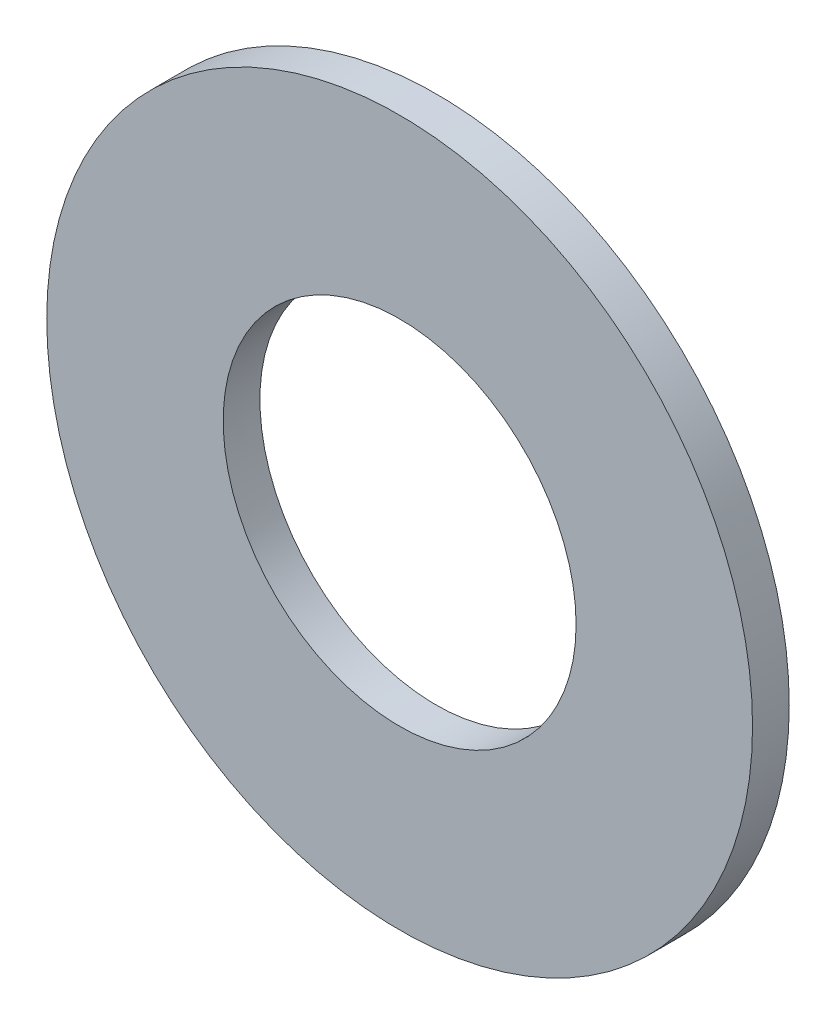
ISO-10303-21;
HEADER;
FILE_DESCRIPTION(('STEP AP214'),'2;1');
FILE_NAME('part.step','',(''),(''),'','','');
FILE_SCHEMA(('AUTOMOTIVE_DESIGN { 1 0 10303 214 1 1 1 1 }'));
ENDSEC;
DATA;
#1=APPLICATION_CONTEXT('core data for automotive mechanical design processes');
#2=APPLICATION_PROTOCOL_DEFINITION('international standard','automotive_design',2000,#1);
#3=PRODUCT_CONTEXT('',#1,'mechanical');
#4=PRODUCT('Part','Part','',(#3));
#5=PRODUCT_RELATED_PRODUCT_CATEGORY('part','',(#4));
#6=PRODUCT_DEFINITION_FORMATION('','',#4);
#7=PRODUCT_DEFINITION_CONTEXT('part definition',#1,'design');
#8=PRODUCT_DEFINITION('design','',#6,#7);
#9=PRODUCT_DEFINITION_SHAPE('','',#8);
#10=(LENGTH_UNIT() NAMED_UNIT(*) SI_UNIT(.MILLI.,.METRE.));
#11=(NAMED_UNIT(*) PLANE_ANGLE_UNIT() SI_UNIT($,.RADIAN.));
#12=(NAMED_UNIT(*) SI_UNIT($,.STERADIAN.) SOLID_ANGLE_UNIT());
#13=UNCERTAINTY_MEASURE_WITH_UNIT(LENGTH_MEASURE(1.E-05),#10,'distance_accuracy_value','');
#14=(GEOMETRIC_REPRESENTATION_CONTEXT(3) GLOBAL_UNCERTAINTY_ASSIGNED_CONTEXT((#13)) GLOBAL_UNIT_ASSIGNED_CONTEXT((#10,
#11,#12)) REPRESENTATION_CONTEXT('',''));
#15=CARTESIAN_POINT('',(0.,0.,0.));
#16=DIRECTION('',(0.,0.,1.));
#17=DIRECTION('',(1.,0.,0.));
#18=AXIS2_PLACEMENT_3D('',#15,#16,#17);
#19=CARTESIAN_POINT('',(0.,0.,0.1651));
#20=DIRECTION('',(0.,0.,-1.));
#21=DIRECTION('',(-1.,0.,0.));
#22=AXIS2_PLACEMENT_3D('',#19,#20,#21);
#23=CYLINDRICAL_SURFACE('',#22,3.175);
#24=CARTESIAN_POINT('',(0.,0.,0.1651));
#25=DIRECTION('',(0.,0.,1.));
#26=DIRECTION('',(1.,0.,0.));
#27=AXIS2_PLACEMENT_3D('',#24,#25,#26);
#28=CIRCLE('',#27,3.175);
#29=CARTESIAN_POINT('',(3.175,0.,0.1651));
#30=VERTEX_POINT('',#29);
#31=EDGE_CURVE('E10',#30,#30,#28,.T.);
#32=ORIENTED_EDGE('',*,*,#31,.F.);
#33=EDGE_LOOP('',(#32));
#34=FACE_BOUND('',#33,.T.);
#35=CARTESIAN_POINT('',(0.,0.,-0.1651));
#36=DIRECTION('',(0.,0.,1.));
#37=DIRECTION('',(1.,0.,0.));
#38=AXIS2_PLACEMENT_3D('',#35,#36,#37);
#39=CIRCLE('',#38,3.175);
#40=CARTESIAN_POINT('',(3.175,0.,-0.1651));
#41=VERTEX_POINT('',#40);
#42=EDGE_CURVE('E35',#41,#41,#39,.T.);
#43=ORIENTED_EDGE('',*,*,#42,.T.);
#44=EDGE_LOOP('',(#43));
#45=FACE_BOUND('',#44,.T.);
#46=ADVANCED_FACE('F29',(#34,#45),#23,.T.);
#47=CARTESIAN_POINT('',(0.,0.,0.1651));
#48=DIRECTION('',(0.,0.,1.));
#49=DIRECTION('',(1.,0.,0.));
#50=AXIS2_PLACEMENT_3D('',#47,#48,#49);
#51=PLANE('',#50);
#52=CARTESIAN_POINT('',(0.,0.,0.165100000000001));
#53=DIRECTION('',(0.,0.,1.));
#54=DIRECTION('',(1.,0.,0.));
#55=AXIS2_PLACEMENT_3D('',#52,#53,#54);
#56=CIRCLE('',#55,1.58749999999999);
#57=CARTESIAN_POINT('',(1.58749999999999,0.,0.165100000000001));
#58=VERTEX_POINT('',#57);
#59=EDGE_CURVE('E43',#58,#58,#56,.T.);
#60=ORIENTED_EDGE('',*,*,#59,.F.);
#61=EDGE_LOOP('',(#60));
#62=FACE_BOUND('',#61,.T.);
#63=ORIENTED_EDGE('',*,*,#31,.T.);
#64=EDGE_LOOP('',(#63));
#65=FACE_BOUND('',#64,.T.);
#66=ADVANCED_FACE('F51',(#62,#65),#51,.T.);
#67=CARTESIAN_POINT('',(0.,0.,-0.1651));
#68=DIRECTION('',(0.,0.,1.));
#69=DIRECTION('',(1.,0.,0.));
#70=AXIS2_PLACEMENT_3D('',#67,#68,#69);
#71=PLANE('',#70);
#72=CARTESIAN_POINT('',(0.,0.,-0.1651));
#73=DIRECTION('',(0.,0.,1.));
#74=DIRECTION('',(1.,0.,0.));
#75=AXIS2_PLACEMENT_3D('',#72,#73,#74);
#76=CIRCLE('',#75,1.5875);
#77=CARTESIAN_POINT('',(1.5875,0.,-0.1651));
#78=VERTEX_POINT('',#77);
#79=EDGE_CURVE('E39',#78,#78,#76,.T.);
#80=ORIENTED_EDGE('',*,*,#79,.T.);
#81=EDGE_LOOP('',(#80));
#82=FACE_BOUND('',#81,.T.);
#83=ORIENTED_EDGE('',*,*,#42,.F.);
#84=EDGE_LOOP('',(#83));
#85=FACE_BOUND('',#84,.T.);
#86=ADVANCED_FACE('F53',(#82,#85),#71,.F.);
#87=CARTESIAN_POINT('',(0.,0.,0.1651));
#88=DIRECTION('',(0.,0.,1.));
#89=DIRECTION('',(1.,0.,0.));
#90=AXIS2_PLACEMENT_3D('',#87,#88,#89);
#91=CYLINDRICAL_SURFACE('',#90,1.58749999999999);
#92=ORIENTED_EDGE('',*,*,#79,.F.);
#93=EDGE_LOOP('',(#92));
#94=FACE_BOUND('',#93,.T.);
#95=ORIENTED_EDGE('',*,*,#59,.T.);
#96=EDGE_LOOP('',(#95));
#97=FACE_BOUND('',#96,.T.);
#98=ADVANCED_FACE('F49',(#94,#97),#91,.F.);
#99=CLOSED_SHELL('',(#46,#66,#86,#98));
#100=MANIFOLD_SOLID_BREP('B2',#99);
#101=ADVANCED_BREP_SHAPE_REPRESENTATION('',(#18,#100),#14);
#102=SHAPE_DEFINITION_REPRESENTATION(#9,#101);
ENDSEC;
END-ISO-10303-21;
